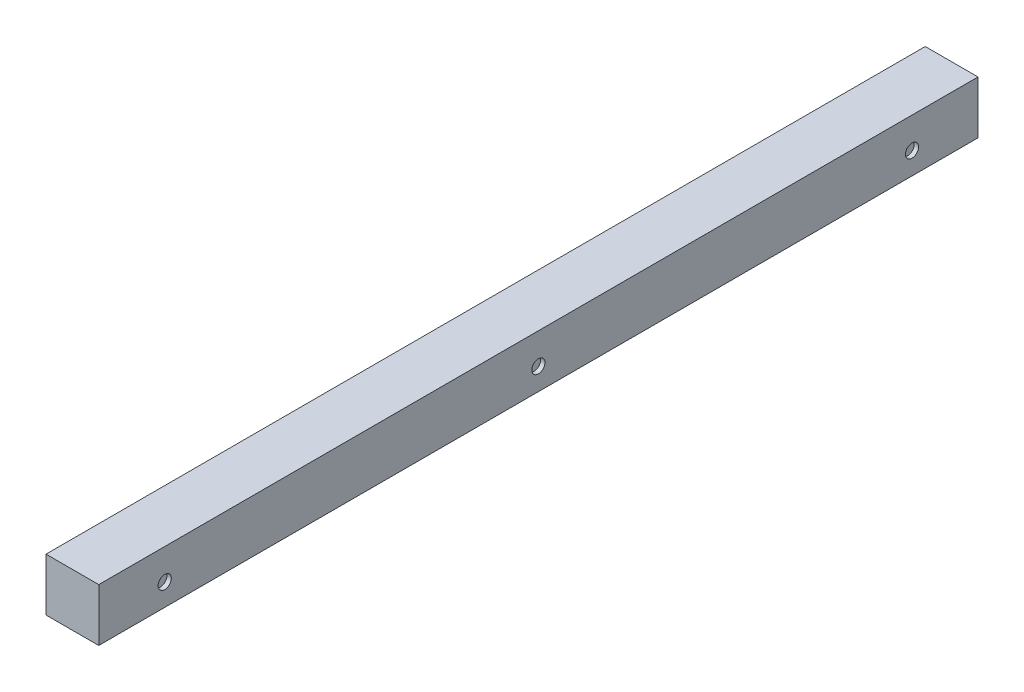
ISO-10303-21;
HEADER;
FILE_DESCRIPTION(('STEP AP214'),'2;1');
FILE_NAME('part.step','',(''),(''),'','','');
FILE_SCHEMA(('AUTOMOTIVE_DESIGN { 1 0 10303 214 1 1 1 1 }'));
ENDSEC;
DATA;
#1=APPLICATION_CONTEXT('core data for automotive mechanical design processes');
#2=APPLICATION_PROTOCOL_DEFINITION('international standard','automotive_design',2000,#1);
#3=PRODUCT_CONTEXT('',#1,'mechanical');
#4=PRODUCT('Part','Part','',(#3));
#5=PRODUCT_RELATED_PRODUCT_CATEGORY('part','',(#4));
#6=PRODUCT_DEFINITION_FORMATION('','',#4);
#7=PRODUCT_DEFINITION_CONTEXT('part definition',#1,'design');
#8=PRODUCT_DEFINITION('design','',#6,#7);
#9=PRODUCT_DEFINITION_SHAPE('','',#8);
#10=(LENGTH_UNIT() NAMED_UNIT(*) SI_UNIT(.MILLI.,.METRE.));
#11=(NAMED_UNIT(*) PLANE_ANGLE_UNIT() SI_UNIT($,.RADIAN.));
#12=(NAMED_UNIT(*) SI_UNIT($,.STERADIAN.) SOLID_ANGLE_UNIT());
#13=UNCERTAINTY_MEASURE_WITH_UNIT(LENGTH_MEASURE(1.E-05),#10,'distance_accuracy_value','');
#14=(GEOMETRIC_REPRESENTATION_CONTEXT(3) GLOBAL_UNCERTAINTY_ASSIGNED_CONTEXT((#13)) GLOBAL_UNIT_ASSIGNED_CONTEXT((#10,
#11,#12)) REPRESENTATION_CONTEXT('',''));
#15=CARTESIAN_POINT('',(0.,0.,0.));
#16=DIRECTION('',(0.,0.,1.));
#17=DIRECTION('',(1.,0.,0.));
#18=AXIS2_PLACEMENT_3D('',#15,#16,#17);
#19=CARTESIAN_POINT('',(-6.,6.,-200.));
#20=DIRECTION('',(-1.,0.,0.));
#21=DIRECTION('',(0.,-1.,0.));
#22=AXIS2_PLACEMENT_3D('',#19,#20,#21);
#23=PLANE('',#22);
#24=DIRECTION('',(0.,-1.,0.));
#25=VECTOR('',#24,1.);
#26=CARTESIAN_POINT('',(-6.,6.,0.));
#27=LINE('',#26,#25);
#28=CARTESIAN_POINT('',(-6.,6.,0.));
#29=VERTEX_POINT('',#28);
#30=CARTESIAN_POINT('',(-6.,-6.,0.));
#31=VERTEX_POINT('',#30);
#32=EDGE_CURVE('E69',#29,#31,#27,.T.);
#33=ORIENTED_EDGE('',*,*,#32,.F.);
#34=DIRECTION('',(0.,0.,1.));
#35=VECTOR('',#34,1.);
#36=CARTESIAN_POINT('',(-6.,6.,-200.));
#37=LINE('',#36,#35);
#38=CARTESIAN_POINT('',(-6.,6.,-200.));
#39=VERTEX_POINT('',#38);
#40=EDGE_CURVE('E41',#39,#29,#37,.T.);
#41=ORIENTED_EDGE('',*,*,#40,.F.);
#42=DIRECTION('',(0.,-1.,0.));
#43=VECTOR('',#42,1.);
#44=CARTESIAN_POINT('',(-6.,6.,-200.));
#45=LINE('',#44,#43);
#46=CARTESIAN_POINT('',(-6.,-6.,-200.));
#47=VERTEX_POINT('',#46);
#48=EDGE_CURVE('E71',#39,#47,#45,.T.);
#49=ORIENTED_EDGE('',*,*,#48,.T.);
#50=DIRECTION('',(0.,0.,1.));
#51=VECTOR('',#50,1.);
#52=CARTESIAN_POINT('',(-6.,-6.,-200.));
#53=LINE('',#52,#51);
#54=EDGE_CURVE('E66',#47,#31,#53,.T.);
#55=ORIENTED_EDGE('',*,*,#54,.T.);
#56=EDGE_LOOP('',(#33,#41,#49,#55));
#57=FACE_BOUND('',#56,.T.);
#58=ADVANCED_FACE('F26',(#57),#23,.T.);
#59=CARTESIAN_POINT('',(-6.,6.,-200.));
#60=DIRECTION('',(0.,1.,0.));
#61=DIRECTION('',(-1.,0.,0.));
#62=AXIS2_PLACEMENT_3D('',#59,#60,#61);
#63=PLANE('',#62);
#64=DIRECTION('',(-1.,0.,0.));
#65=VECTOR('',#64,1.);
#66=CARTESIAN_POINT('',(-6.,6.,0.));
#67=LINE('',#66,#65);
#68=CARTESIAN_POINT('',(6.,6.00000000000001,0.));
#69=VERTEX_POINT('',#68);
#70=EDGE_CURVE('E87',#69,#29,#67,.T.);
#71=ORIENTED_EDGE('',*,*,#70,.F.);
#72=DIRECTION('',(0.,0.,1.));
#73=VECTOR('',#72,1.);
#74=CARTESIAN_POINT('',(6.,6.00000000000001,-200.));
#75=LINE('',#74,#73);
#76=CARTESIAN_POINT('',(6.,6.00000000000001,-200.));
#77=VERTEX_POINT('',#76);
#78=EDGE_CURVE('E49',#77,#69,#75,.T.);
#79=ORIENTED_EDGE('',*,*,#78,.F.);
#80=DIRECTION('',(-1.,0.,0.));
#81=VECTOR('',#80,1.);
#82=CARTESIAN_POINT('',(-6.,6.,-200.));
#83=LINE('',#82,#81);
#84=EDGE_CURVE('E76',#77,#39,#83,.T.);
#85=ORIENTED_EDGE('',*,*,#84,.T.);
#86=ORIENTED_EDGE('',*,*,#40,.T.);
#87=EDGE_LOOP('',(#71,#79,#85,#86));
#88=FACE_BOUND('',#87,.T.);
#89=ADVANCED_FACE('F112',(#88),#63,.T.);
#90=CARTESIAN_POINT('',(6.,6.00000000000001,-200.));
#91=DIRECTION('',(1.,0.,0.));
#92=DIRECTION('',(0.,1.,0.));
#93=AXIS2_PLACEMENT_3D('',#90,#91,#92);
#94=PLANE('',#93);
#95=CARTESIAN_POINT('',(6.00000000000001,-0.999999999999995,-100.));
#96=DIRECTION('',(1.,0.,0.));
#97=DIRECTION('',(0.,1.,0.));
#98=AXIS2_PLACEMENT_3D('',#95,#96,#97);
#99=CIRCLE('',#98,1.5);
#100=CARTESIAN_POINT('',(6.00000000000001,0.500000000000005,-100.));
#101=VERTEX_POINT('',#100);
#102=EDGE_CURVE('E209',#101,#101,#99,.T.);
#103=ORIENTED_EDGE('',*,*,#102,.F.);
#104=EDGE_LOOP('',(#103));
#105=FACE_BOUND('',#104,.T.);
#106=CARTESIAN_POINT('',(6.00000000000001,-0.999999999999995,-15.));
#107=DIRECTION('',(1.,0.,0.));
#108=DIRECTION('',(0.,1.,0.));
#109=AXIS2_PLACEMENT_3D('',#106,#107,#108);
#110=CIRCLE('',#109,1.5);
#111=CARTESIAN_POINT('',(6.00000000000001,0.500000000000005,-15.));
#112=VERTEX_POINT('',#111);
#113=EDGE_CURVE('E91',#112,#112,#110,.T.);
#114=ORIENTED_EDGE('',*,*,#113,.F.);
#115=EDGE_LOOP('',(#114));
#116=FACE_BOUND('',#115,.T.);
#117=DIRECTION('',(0.,1.,0.));
#118=VECTOR('',#117,1.);
#119=CARTESIAN_POINT('',(6.,6.00000000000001,0.));
#120=LINE('',#119,#118);
#121=CARTESIAN_POINT('',(6.00000000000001,-5.99999999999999,0.));
#122=VERTEX_POINT('',#121);
#123=EDGE_CURVE('E84',#122,#69,#120,.T.);
#124=ORIENTED_EDGE('',*,*,#123,.F.);
#125=DIRECTION('',(0.,0.,1.));
#126=VECTOR('',#125,1.);
#127=CARTESIAN_POINT('',(6.00000000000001,-5.99999999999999,-200.));
#128=LINE('',#127,#126);
#129=CARTESIAN_POINT('',(6.00000000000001,-5.99999999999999,-200.));
#130=VERTEX_POINT('',#129);
#131=EDGE_CURVE('E75',#130,#122,#128,.T.);
#132=ORIENTED_EDGE('',*,*,#131,.F.);
#133=DIRECTION('',(0.,1.,0.));
#134=VECTOR('',#133,1.);
#135=CARTESIAN_POINT('',(6.,6.00000000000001,-200.));
#136=LINE('',#135,#134);
#137=EDGE_CURVE('E100',#130,#77,#136,.T.);
#138=ORIENTED_EDGE('',*,*,#137,.T.);
#139=ORIENTED_EDGE('',*,*,#78,.T.);
#140=EDGE_LOOP('',(#124,#132,#138,#139));
#141=FACE_BOUND('',#140,.T.);
#142=CARTESIAN_POINT('',(6.00000000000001,-0.999999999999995,-185.));
#143=DIRECTION('',(1.,0.,0.));
#144=DIRECTION('',(0.,1.,0.));
#145=AXIS2_PLACEMENT_3D('',#142,#143,#144);
#146=CIRCLE('',#145,1.5);
#147=CARTESIAN_POINT('',(6.00000000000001,0.500000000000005,-185.));
#148=VERTEX_POINT('',#147);
#149=EDGE_CURVE('E34',#148,#148,#146,.T.);
#150=ORIENTED_EDGE('',*,*,#149,.F.);
#151=EDGE_LOOP('',(#150));
#152=FACE_BOUND('',#151,.T.);
#153=ADVANCED_FACE('F110',(#105,#116,#141,#152),#94,.T.);
#154=CARTESIAN_POINT('',(-6.,-6.,-200.));
#155=DIRECTION('',(0.,-1.,0.));
#156=DIRECTION('',(1.,0.,0.));
#157=AXIS2_PLACEMENT_3D('',#154,#155,#156);
#158=PLANE('',#157);
#159=DIRECTION('',(1.,0.,0.));
#160=VECTOR('',#159,1.);
#161=CARTESIAN_POINT('',(-6.,-6.,0.));
#162=LINE('',#161,#160);
#163=EDGE_CURVE('E79',#31,#122,#162,.T.);
#164=ORIENTED_EDGE('',*,*,#163,.F.);
#165=ORIENTED_EDGE('',*,*,#54,.F.);
#166=DIRECTION('',(1.,0.,0.));
#167=VECTOR('',#166,1.);
#168=CARTESIAN_POINT('',(-6.,-6.,-200.));
#169=LINE('',#168,#167);
#170=EDGE_CURVE('E98',#47,#130,#169,.T.);
#171=ORIENTED_EDGE('',*,*,#170,.T.);
#172=ORIENTED_EDGE('',*,*,#131,.T.);
#173=EDGE_LOOP('',(#164,#165,#171,#172));
#174=FACE_BOUND('',#173,.T.);
#175=ADVANCED_FACE('F80',(#174),#158,.T.);
#176=CARTESIAN_POINT('',(-6.,-6.,-200.));
#177=DIRECTION('',(0.,0.,1.));
#178=DIRECTION('',(1.,0.,0.));
#179=AXIS2_PLACEMENT_3D('',#176,#177,#178);
#180=PLANE('',#179);
#181=ORIENTED_EDGE('',*,*,#48,.F.);
#182=ORIENTED_EDGE('',*,*,#84,.F.);
#183=ORIENTED_EDGE('',*,*,#137,.F.);
#184=ORIENTED_EDGE('',*,*,#170,.F.);
#185=EDGE_LOOP('',(#181,#182,#183,#184));
#186=FACE_BOUND('',#185,.T.);
#187=ADVANCED_FACE('F120',(#186),#180,.F.);
#188=CARTESIAN_POINT('',(-6.,-6.,0.));
#189=DIRECTION('',(0.,0.,1.));
#190=DIRECTION('',(1.,0.,0.));
#191=AXIS2_PLACEMENT_3D('',#188,#189,#190);
#192=PLANE('',#191);
#193=ORIENTED_EDGE('',*,*,#32,.T.);
#194=ORIENTED_EDGE('',*,*,#163,.T.);
#195=ORIENTED_EDGE('',*,*,#123,.T.);
#196=ORIENTED_EDGE('',*,*,#70,.T.);
#197=EDGE_LOOP('',(#193,#194,#195,#196));
#198=FACE_BOUND('',#197,.T.);
#199=ADVANCED_FACE('F86',(#198),#192,.T.);
#200=CARTESIAN_POINT('',(5.00000000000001,-0.999999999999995,-15.));
#201=DIRECTION('',(1.,0.,0.));
#202=DIRECTION('',(0.,1.,0.));
#203=AXIS2_PLACEMENT_3D('',#200,#201,#202);
#204=CYLINDRICAL_SURFACE('',#203,1.5);
#205=CARTESIAN_POINT('',(5.00000000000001,-0.999999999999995,-15.));
#206=DIRECTION('',(1.,0.,0.));
#207=DIRECTION('',(0.,1.,0.));
#208=AXIS2_PLACEMENT_3D('',#205,#206,#207);
#209=CIRCLE('',#208,1.5);
#210=CARTESIAN_POINT('',(5.00000000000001,0.500000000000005,-15.));
#211=VERTEX_POINT('',#210);
#212=EDGE_CURVE('E88',#211,#211,#209,.T.);
#213=ORIENTED_EDGE('',*,*,#212,.F.);
#214=EDGE_LOOP('',(#213));
#215=FACE_BOUND('',#214,.T.);
#216=ORIENTED_EDGE('',*,*,#113,.T.);
#217=EDGE_LOOP('',(#216));
#218=FACE_BOUND('',#217,.T.);
#219=ADVANCED_FACE('F149',(#215,#218),#204,.F.);
#220=CARTESIAN_POINT('',(5.00000000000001,-0.999999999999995,-15.));
#221=DIRECTION('',(1.,0.,0.));
#222=DIRECTION('',(0.,1.,0.));
#223=AXIS2_PLACEMENT_3D('',#220,#221,#222);
#224=PLANE('',#223);
#225=ORIENTED_EDGE('',*,*,#212,.T.);
#226=EDGE_LOOP('',(#225));
#227=FACE_BOUND('',#226,.T.);
#228=ADVANCED_FACE('F144',(#227),#224,.T.);
#229=CARTESIAN_POINT('',(5.00000000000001,-0.999999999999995,-100.));
#230=DIRECTION('',(1.,0.,0.));
#231=DIRECTION('',(0.,1.,0.));
#232=AXIS2_PLACEMENT_3D('',#229,#230,#231);
#233=CYLINDRICAL_SURFACE('',#232,1.5);
#234=CARTESIAN_POINT('',(5.00000000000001,-0.999999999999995,-100.));
#235=DIRECTION('',(1.,0.,0.));
#236=DIRECTION('',(0.,1.,0.));
#237=AXIS2_PLACEMENT_3D('',#234,#235,#236);
#238=CIRCLE('',#237,1.5);
#239=CARTESIAN_POINT('',(5.00000000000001,0.500000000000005,-100.));
#240=VERTEX_POINT('',#239);
#241=EDGE_CURVE('E207',#240,#240,#238,.T.);
#242=ORIENTED_EDGE('',*,*,#241,.F.);
#243=EDGE_LOOP('',(#242));
#244=FACE_BOUND('',#243,.T.);
#245=ORIENTED_EDGE('',*,*,#102,.T.);
#246=EDGE_LOOP('',(#245));
#247=FACE_BOUND('',#246,.T.);
#248=ADVANCED_FACE('F137',(#244,#247),#233,.F.);
#249=CARTESIAN_POINT('',(5.00000000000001,-0.999999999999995,-100.));
#250=DIRECTION('',(1.,0.,0.));
#251=DIRECTION('',(0.,1.,0.));
#252=AXIS2_PLACEMENT_3D('',#249,#250,#251);
#253=PLANE('',#252);
#254=ORIENTED_EDGE('',*,*,#241,.T.);
#255=EDGE_LOOP('',(#254));
#256=FACE_BOUND('',#255,.T.);
#257=ADVANCED_FACE('F135',(#256),#253,.T.);
#258=CARTESIAN_POINT('',(5.00000000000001,-0.999999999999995,-185.));
#259=DIRECTION('',(1.,0.,0.));
#260=DIRECTION('',(0.,1.,0.));
#261=AXIS2_PLACEMENT_3D('',#258,#259,#260);
#262=PLANE('',#261);
#263=CARTESIAN_POINT('',(5.00000000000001,-0.999999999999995,-185.));
#264=DIRECTION('',(1.,0.,0.));
#265=DIRECTION('',(0.,1.,0.));
#266=AXIS2_PLACEMENT_3D('',#263,#264,#265);
#267=CIRCLE('',#266,1.5);
#268=CARTESIAN_POINT('',(5.00000000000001,0.500000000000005,-185.));
#269=VERTEX_POINT('',#268);
#270=EDGE_CURVE('E11',#269,#269,#267,.T.);
#271=ORIENTED_EDGE('',*,*,#270,.T.);
#272=EDGE_LOOP('',(#271));
#273=FACE_BOUND('',#272,.T.);
#274=ADVANCED_FACE('F28',(#273),#262,.T.);
#275=CARTESIAN_POINT('',(5.00000000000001,-0.999999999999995,-185.));
#276=DIRECTION('',(1.,0.,0.));
#277=DIRECTION('',(0.,1.,0.));
#278=AXIS2_PLACEMENT_3D('',#275,#276,#277);
#279=CYLINDRICAL_SURFACE('',#278,1.5);
#280=ORIENTED_EDGE('',*,*,#270,.F.);
#281=EDGE_LOOP('',(#280));
#282=FACE_BOUND('',#281,.T.);
#283=ORIENTED_EDGE('',*,*,#149,.T.);
#284=EDGE_LOOP('',(#283));
#285=FACE_BOUND('',#284,.T.);
#286=ADVANCED_FACE('F108',(#282,#285),#279,.F.);
#287=CLOSED_SHELL('',(#58,#89,#153,#175,#187,#199,#219,#228,#248,#257,#274,#286));
#288=MANIFOLD_SOLID_BREP('B2',#287);
#289=ADVANCED_BREP_SHAPE_REPRESENTATION('',(#18,#288),#14);
#290=SHAPE_DEFINITION_REPRESENTATION(#9,#289);
ENDSEC;
END-ISO-10303-21;
